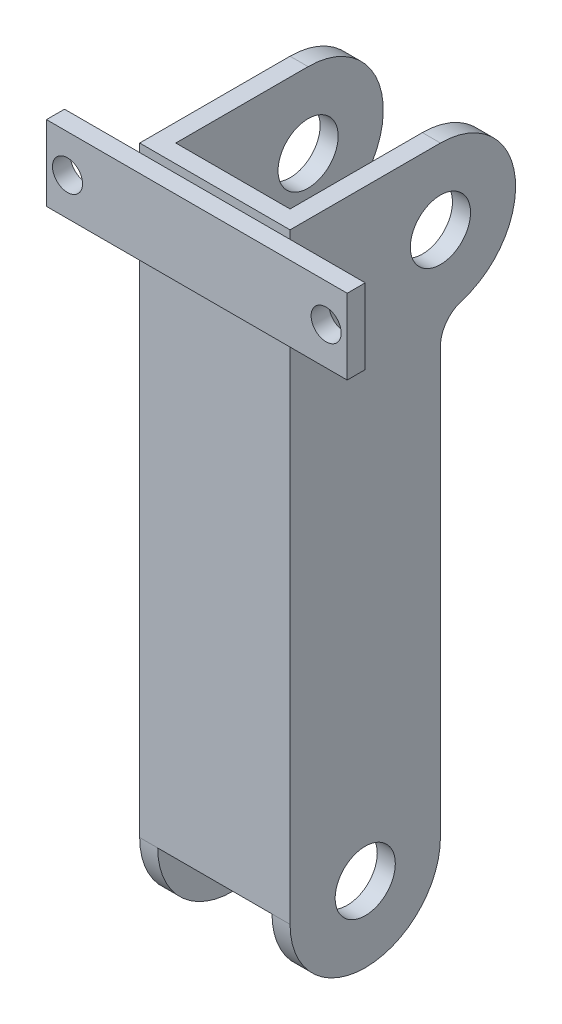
ISO-10303-21;
HEADER;
FILE_DESCRIPTION(('STEP AP214'),'2;1');
FILE_NAME('part.step','',(''),(''),'','','');
FILE_SCHEMA(('AUTOMOTIVE_DESIGN { 1 0 10303 214 1 1 1 1 }'));
ENDSEC;
DATA;
#1=APPLICATION_CONTEXT('core data for automotive mechanical design processes');
#2=APPLICATION_PROTOCOL_DEFINITION('international standard','automotive_design',2000,#1);
#3=PRODUCT_CONTEXT('',#1,'mechanical');
#4=PRODUCT('Part','Part','',(#3));
#5=PRODUCT_RELATED_PRODUCT_CATEGORY('part','',(#4));
#6=PRODUCT_DEFINITION_FORMATION('','',#4);
#7=PRODUCT_DEFINITION_CONTEXT('part definition',#1,'design');
#8=PRODUCT_DEFINITION('design','',#6,#7);
#9=PRODUCT_DEFINITION_SHAPE('','',#8);
#10=(LENGTH_UNIT() NAMED_UNIT(*) SI_UNIT(.MILLI.,.METRE.));
#11=(NAMED_UNIT(*) PLANE_ANGLE_UNIT() SI_UNIT($,.RADIAN.));
#12=(NAMED_UNIT(*) SI_UNIT($,.STERADIAN.) SOLID_ANGLE_UNIT());
#13=UNCERTAINTY_MEASURE_WITH_UNIT(LENGTH_MEASURE(1.E-05),#10,'distance_accuracy_value','');
#14=(GEOMETRIC_REPRESENTATION_CONTEXT(3) GLOBAL_UNCERTAINTY_ASSIGNED_CONTEXT((#13)) GLOBAL_UNIT_ASSIGNED_CONTEXT((#10,
#11,#12)) REPRESENTATION_CONTEXT('',''));
#15=CARTESIAN_POINT('',(0.,0.,0.));
#16=DIRECTION('',(0.,0.,1.));
#17=DIRECTION('',(1.,0.,0.));
#18=AXIS2_PLACEMENT_3D('',#15,#16,#17);
#19=CARTESIAN_POINT('',(6.,0.,25.));
#20=DIRECTION('',(0.,0.,-1.));
#21=DIRECTION('',(0.,1.,0.));
#22=AXIS2_PLACEMENT_3D('',#19,#20,#21);
#23=PLANE('',#22);
#24=DIRECTION('',(1.,0.,0.));
#25=VECTOR('',#24,1.);
#26=CARTESIAN_POINT('',(75.,172.244241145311,25.));
#27=LINE('',#26,#25);
#28=CARTESIAN_POINT('',(0.,172.244241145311,25.));
#29=VERTEX_POINT('',#28);
#30=CARTESIAN_POINT('',(50.,172.244241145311,25.));
#31=VERTEX_POINT('',#30);
#32=EDGE_CURVE('E193',#29,#31,#27,.T.);
#33=ORIENTED_EDGE('',*,*,#32,.F.);
#34=DIRECTION('',(0.,-1.,0.));
#35=VECTOR('',#34,1.);
#36=CARTESIAN_POINT('',(0.,0.,25.));
#37=LINE('',#36,#35);
#38=CARTESIAN_POINT('',(0.,0.,25.));
#39=VERTEX_POINT('',#38);
#40=EDGE_CURVE('E443',#29,#39,#37,.T.);
#41=ORIENTED_EDGE('',*,*,#40,.T.);
#42=DIRECTION('',(-1.,0.,0.));
#43=VECTOR('',#42,1.);
#44=CARTESIAN_POINT('',(6.,0.,25.));
#45=LINE('',#44,#43);
#46=CARTESIAN_POINT('',(6.,0.,25.));
#47=VERTEX_POINT('',#46);
#48=EDGE_CURVE('E461',#47,#39,#45,.T.);
#49=ORIENTED_EDGE('',*,*,#48,.F.);
#50=DIRECTION('',(1.,0.,0.));
#51=VECTOR('',#50,1.);
#52=CARTESIAN_POINT('',(0.,0.,25.));
#53=LINE('',#52,#51);
#54=CARTESIAN_POINT('',(44.,0.,25.));
#55=VERTEX_POINT('',#54);
#56=EDGE_CURVE('E400',#47,#55,#53,.T.);
#57=ORIENTED_EDGE('',*,*,#56,.T.);
#58=DIRECTION('',(1.,0.,0.));
#59=VECTOR('',#58,1.);
#60=CARTESIAN_POINT('',(44.,0.,25.));
#61=LINE('',#60,#59);
#62=CARTESIAN_POINT('',(50.,0.,25.));
#63=VERTEX_POINT('',#62);
#64=EDGE_CURVE('E387',#55,#63,#61,.T.);
#65=ORIENTED_EDGE('',*,*,#64,.T.);
#66=DIRECTION('',(0.,1.,0.));
#67=VECTOR('',#66,1.);
#68=CARTESIAN_POINT('',(50.,0.,25.));
#69=LINE('',#68,#67);
#70=EDGE_CURVE('E405',#63,#31,#69,.T.);
#71=ORIENTED_EDGE('',*,*,#70,.T.);
#72=EDGE_LOOP('',(#33,#41,#49,#57,#65,#71));
#73=FACE_BOUND('',#72,.T.);
#74=ADVANCED_FACE('F179',(#73),#23,.F.);
#75=DIRECTION('',(-1.,0.,0.));
#76=VECTOR('',#75,1.);
#77=CARTESIAN_POINT('',(75.,197.244241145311,25.));
#78=LINE('',#77,#76);
#79=CARTESIAN_POINT('',(50.,197.244241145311,25.));
#80=VERTEX_POINT('',#79);
#81=CARTESIAN_POINT('',(0.,197.244241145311,25.));
#82=VERTEX_POINT('',#81);
#83=EDGE_CURVE('E202',#80,#82,#78,.T.);
#84=ORIENTED_EDGE('',*,*,#83,.F.);
#85=CARTESIAN_POINT('',(50.,200.,25.));
#86=VERTEX_POINT('',#85);
#87=EDGE_CURVE('E410',#80,#86,#69,.T.);
#88=ORIENTED_EDGE('',*,*,#87,.T.);
#89=DIRECTION('',(-1.,0.,0.));
#90=VECTOR('',#89,1.);
#91=CARTESIAN_POINT('',(6.,200.,25.));
#92=LINE('',#91,#90);
#93=CARTESIAN_POINT('',(0.,200.,25.));
#94=VERTEX_POINT('',#93);
#95=EDGE_CURVE('E463',#86,#94,#92,.T.);
#96=ORIENTED_EDGE('',*,*,#95,.T.);
#97=EDGE_CURVE('E444',#94,#82,#37,.T.);
#98=ORIENTED_EDGE('',*,*,#97,.T.);
#99=EDGE_LOOP('',(#84,#88,#96,#98));
#100=FACE_BOUND('',#99,.T.);
#101=ADVANCED_FACE('F509',(#100),#23,.F.);
#102=CARTESIAN_POINT('',(6.,175.,-25.));
#103=DIRECTION('',(1.,0.,0.));
#104=DIRECTION('',(0.,0.,-1.));
#105=AXIS2_PLACEMENT_3D('',#102,#103,#104);
#106=PLANE('',#105);
#107=DIRECTION('',(0.,0.,-1.));
#108=VECTOR('',#107,1.);
#109=CARTESIAN_POINT('',(6.,0.,-25.));
#110=LINE('',#109,#108);
#111=CARTESIAN_POINT('',(6.,0.,19.));
#112=VERTEX_POINT('',#111);
#113=EDGE_CURVE('E189',#47,#112,#110,.T.);
#114=ORIENTED_EDGE('',*,*,#113,.F.);
#115=CARTESIAN_POINT('',(6.,0.,0.));
#116=DIRECTION('',(1.,0.,0.));
#117=DIRECTION('',(0.,0.,-1.));
#118=AXIS2_PLACEMENT_3D('',#115,#116,#117);
#119=CIRCLE('',#118,25.);
#120=CARTESIAN_POINT('',(6.,0.,-25.));
#121=VERTEX_POINT('',#120);
#122=EDGE_CURVE('E435',#47,#121,#119,.T.);
#123=ORIENTED_EDGE('',*,*,#122,.T.);
#124=DIRECTION('',(0.,1.,0.));
#125=VECTOR('',#124,1.);
#126=CARTESIAN_POINT('',(6.,0.,-25.));
#127=LINE('',#126,#125);
#128=CARTESIAN_POINT('',(6.,141.458980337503,-25.));
#129=VERTEX_POINT('',#128);
#130=EDGE_CURVE('E432',#121,#129,#127,.T.);
#131=ORIENTED_EDGE('',*,*,#130,.T.);
#132=CARTESIAN_POINT('',(6.,141.458980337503,-35.));
#133=DIRECTION('',(-1.,0.,0.));
#134=DIRECTION('',(0.,0.,-1.));
#135=AXIS2_PLACEMENT_3D('',#132,#133,#134);
#136=CIRCLE('',#135,10.);
#137=CARTESIAN_POINT('',(6.,151.042128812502,-32.1428571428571));
#138=VERTEX_POINT('',#137);
#139=EDGE_CURVE('E436',#129,#138,#136,.T.);
#140=ORIENTED_EDGE('',*,*,#139,.T.);
#141=CARTESIAN_POINT('',(6.,175.,-25.));
#142=DIRECTION('',(1.,0.,0.));
#143=DIRECTION('',(0.,0.,-1.));
#144=AXIS2_PLACEMENT_3D('',#141,#142,#143);
#145=CIRCLE('',#144,25.);
#146=CARTESIAN_POINT('',(6.,200.,-25.));
#147=VERTEX_POINT('',#146);
#148=EDGE_CURVE('E424',#138,#147,#145,.T.);
#149=ORIENTED_EDGE('',*,*,#148,.T.);
#150=DIRECTION('',(0.,0.,1.));
#151=VECTOR('',#150,1.);
#152=CARTESIAN_POINT('',(6.,200.,-25.));
#153=LINE('',#152,#151);
#154=CARTESIAN_POINT('',(6.,200.,19.));
#155=VERTEX_POINT('',#154);
#156=EDGE_CURVE('E426',#147,#155,#153,.T.);
#157=ORIENTED_EDGE('',*,*,#156,.T.);
#158=DIRECTION('',(0.,1.,0.));
#159=VECTOR('',#158,1.);
#160=CARTESIAN_POINT('',(6.,175.,19.));
#161=LINE('',#160,#159);
#162=EDGE_CURVE('E469',#112,#155,#161,.T.);
#163=ORIENTED_EDGE('',*,*,#162,.F.);
#164=EDGE_LOOP('',(#114,#123,#131,#140,#149,#157,#163));
#165=FACE_BOUND('',#164,.T.);
#166=CARTESIAN_POINT('',(6.,0.,0.));
#167=DIRECTION('',(1.,0.,0.));
#168=DIRECTION('',(0.,0.,-1.));
#169=AXIS2_PLACEMENT_3D('',#166,#167,#168);
#170=CIRCLE('',#169,10.);
#171=CARTESIAN_POINT('',(6.,0.,-10.));
#172=VERTEX_POINT('',#171);
#173=EDGE_CURVE('E418',#172,#172,#170,.T.);
#174=ORIENTED_EDGE('',*,*,#173,.F.);
#175=EDGE_LOOP('',(#174));
#176=FACE_BOUND('',#175,.T.);
#177=CARTESIAN_POINT('',(6.,175.,-25.));
#178=DIRECTION('',(1.,0.,0.));
#179=DIRECTION('',(0.,0.,-1.));
#180=AXIS2_PLACEMENT_3D('',#177,#178,#179);
#181=CIRCLE('',#180,10.);
#182=CARTESIAN_POINT('',(6.,175.,-35.));
#183=VERTEX_POINT('',#182);
#184=EDGE_CURVE('E413',#183,#183,#181,.T.);
#185=ORIENTED_EDGE('',*,*,#184,.F.);
#186=EDGE_LOOP('',(#185));
#187=FACE_BOUND('',#186,.T.);
#188=ADVANCED_FACE('F579',(#165,#176,#187),#106,.T.);
#189=CARTESIAN_POINT('',(0.,175.,-25.));
#190=DIRECTION('',(1.,0.,0.));
#191=DIRECTION('',(0.,0.,-1.));
#192=AXIS2_PLACEMENT_3D('',#189,#190,#191);
#193=PLANE('',#192);
#194=ORIENTED_EDGE('',*,*,#97,.F.);
#195=DIRECTION('',(0.,0.,1.));
#196=VECTOR('',#195,1.);
#197=CARTESIAN_POINT('',(0.,200.,-25.));
#198=LINE('',#197,#196);
#199=CARTESIAN_POINT('',(0.,200.,-25.));
#200=VERTEX_POINT('',#199);
#201=EDGE_CURVE('E441',#200,#94,#198,.T.);
#202=ORIENTED_EDGE('',*,*,#201,.F.);
#203=CARTESIAN_POINT('',(0.,175.,-25.));
#204=DIRECTION('',(1.,0.,0.));
#205=DIRECTION('',(0.,0.,-1.));
#206=AXIS2_PLACEMENT_3D('',#203,#204,#205);
#207=CIRCLE('',#206,25.);
#208=CARTESIAN_POINT('',(0.,151.042128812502,-32.1428571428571));
#209=VERTEX_POINT('',#208);
#210=EDGE_CURVE('E422',#209,#200,#207,.T.);
#211=ORIENTED_EDGE('',*,*,#210,.F.);
#212=CARTESIAN_POINT('',(0.,141.458980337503,-35.));
#213=DIRECTION('',(-1.,0.,0.));
#214=DIRECTION('',(0.,0.,-1.));
#215=AXIS2_PLACEMENT_3D('',#212,#213,#214);
#216=CIRCLE('',#215,10.);
#217=CARTESIAN_POINT('',(0.,141.458980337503,-25.));
#218=VERTEX_POINT('',#217);
#219=EDGE_CURVE('E429',#218,#209,#216,.T.);
#220=ORIENTED_EDGE('',*,*,#219,.F.);
#221=DIRECTION('',(0.,1.,0.));
#222=VECTOR('',#221,1.);
#223=CARTESIAN_POINT('',(0.,0.,-25.));
#224=LINE('',#223,#222);
#225=CARTESIAN_POINT('',(0.,0.,-25.));
#226=VERTEX_POINT('',#225);
#227=EDGE_CURVE('E448',#226,#218,#224,.T.);
#228=ORIENTED_EDGE('',*,*,#227,.F.);
#229=CARTESIAN_POINT('',(0.,0.,0.));
#230=DIRECTION('',(1.,0.,0.));
#231=DIRECTION('',(0.,0.,-1.));
#232=AXIS2_PLACEMENT_3D('',#229,#230,#231);
#233=CIRCLE('',#232,25.);
#234=EDGE_CURVE('E450',#39,#226,#233,.T.);
#235=ORIENTED_EDGE('',*,*,#234,.F.);
#236=ORIENTED_EDGE('',*,*,#40,.F.);
#237=EDGE_CURVE('E449',#82,#29,#37,.T.);
#238=ORIENTED_EDGE('',*,*,#237,.F.);
#239=EDGE_LOOP('',(#194,#202,#211,#220,#228,#235,#236,#238));
#240=FACE_BOUND('',#239,.T.);
#241=CARTESIAN_POINT('',(0.,175.,-25.));
#242=DIRECTION('',(1.,0.,0.));
#243=DIRECTION('',(0.,0.,-1.));
#244=AXIS2_PLACEMENT_3D('',#241,#242,#243);
#245=CIRCLE('',#244,10.);
#246=CARTESIAN_POINT('',(0.,175.,-35.));
#247=VERTEX_POINT('',#246);
#248=EDGE_CURVE('E415',#247,#247,#245,.T.);
#249=ORIENTED_EDGE('',*,*,#248,.T.);
#250=EDGE_LOOP('',(#249));
#251=FACE_BOUND('',#250,.T.);
#252=CARTESIAN_POINT('',(0.,0.,0.));
#253=DIRECTION('',(1.,0.,0.));
#254=DIRECTION('',(0.,0.,-1.));
#255=AXIS2_PLACEMENT_3D('',#252,#253,#254);
#256=CIRCLE('',#255,10.);
#257=CARTESIAN_POINT('',(0.,0.,-10.));
#258=VERTEX_POINT('',#257);
#259=EDGE_CURVE('E416',#258,#258,#256,.T.);
#260=ORIENTED_EDGE('',*,*,#259,.T.);
#261=EDGE_LOOP('',(#260));
#262=FACE_BOUND('',#261,.T.);
#263=ADVANCED_FACE('F517',(#240,#251,#262),#193,.F.);
#264=CARTESIAN_POINT('',(6.,175.,-25.));
#265=DIRECTION('',(-1.,0.,0.));
#266=DIRECTION('',(0.,0.,1.));
#267=AXIS2_PLACEMENT_3D('',#264,#265,#266);
#268=CYLINDRICAL_SURFACE('',#267,25.);
#269=ORIENTED_EDGE('',*,*,#210,.T.);
#270=DIRECTION('',(-1.,0.,0.));
#271=VECTOR('',#270,1.);
#272=CARTESIAN_POINT('',(6.,200.,-25.));
#273=LINE('',#272,#271);
#274=EDGE_CURVE('E467',#147,#200,#273,.T.);
#275=ORIENTED_EDGE('',*,*,#274,.F.);
#276=ORIENTED_EDGE('',*,*,#148,.F.);
#277=DIRECTION('',(-1.,0.,0.));
#278=VECTOR('',#277,1.);
#279=CARTESIAN_POINT('',(6.,151.042128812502,-32.1428571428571));
#280=LINE('',#279,#278);
#281=EDGE_CURVE('E438',#138,#209,#280,.T.);
#282=ORIENTED_EDGE('',*,*,#281,.T.);
#283=EDGE_LOOP('',(#269,#275,#276,#282));
#284=FACE_BOUND('',#283,.T.);
#285=ADVANCED_FACE('F185',(#284),#268,.T.);
#286=CARTESIAN_POINT('',(6.,200.,-25.));
#287=DIRECTION('',(0.,-1.,0.));
#288=DIRECTION('',(0.,0.,-1.));
#289=AXIS2_PLACEMENT_3D('',#286,#287,#288);
#290=PLANE('',#289);
#291=DIRECTION('',(0.,0.,1.));
#292=VECTOR('',#291,1.);
#293=CARTESIAN_POINT('',(50.,200.,19.));
#294=LINE('',#293,#292);
#295=CARTESIAN_POINT('',(50.,200.,-25.));
#296=VERTEX_POINT('',#295);
#297=EDGE_CURVE('E404',#296,#86,#294,.T.);
#298=ORIENTED_EDGE('',*,*,#297,.F.);
#299=DIRECTION('',(1.,0.,0.));
#300=VECTOR('',#299,1.);
#301=CARTESIAN_POINT('',(44.,200.,-25.));
#302=LINE('',#301,#300);
#303=CARTESIAN_POINT('',(44.,200.,-25.));
#304=VERTEX_POINT('',#303);
#305=EDGE_CURVE('E373',#304,#296,#302,.T.);
#306=ORIENTED_EDGE('',*,*,#305,.F.);
#307=DIRECTION('',(0.,0.,1.));
#308=VECTOR('',#307,1.);
#309=CARTESIAN_POINT('',(44.,200.,-25.));
#310=LINE('',#309,#308);
#311=CARTESIAN_POINT('',(44.,200.,19.));
#312=VERTEX_POINT('',#311);
#313=EDGE_CURVE('E369',#304,#312,#310,.T.);
#314=ORIENTED_EDGE('',*,*,#313,.T.);
#315=DIRECTION('',(-1.,0.,0.));
#316=VECTOR('',#315,1.);
#317=CARTESIAN_POINT('',(0.,200.,19.));
#318=LINE('',#317,#316);
#319=EDGE_CURVE('E402',#312,#155,#318,.T.);
#320=ORIENTED_EDGE('',*,*,#319,.T.);
#321=ORIENTED_EDGE('',*,*,#156,.F.);
#322=ORIENTED_EDGE('',*,*,#274,.T.);
#323=ORIENTED_EDGE('',*,*,#201,.T.);
#324=ORIENTED_EDGE('',*,*,#95,.F.);
#325=EDGE_LOOP('',(#298,#306,#314,#320,#321,#322,#323,#324));
#326=FACE_BOUND('',#325,.T.);
#327=ADVANCED_FACE('F488',(#326),#290,.F.);
#328=CARTESIAN_POINT('',(6.,0.,0.));
#329=DIRECTION('',(-1.,0.,0.));
#330=DIRECTION('',(0.,0.,1.));
#331=AXIS2_PLACEMENT_3D('',#328,#329,#330);
#332=CYLINDRICAL_SURFACE('',#331,25.);
#333=ORIENTED_EDGE('',*,*,#234,.T.);
#334=DIRECTION('',(-1.,0.,0.));
#335=VECTOR('',#334,1.);
#336=CARTESIAN_POINT('',(6.,0.,-25.));
#337=LINE('',#336,#335);
#338=EDGE_CURVE('E458',#121,#226,#337,.T.);
#339=ORIENTED_EDGE('',*,*,#338,.F.);
#340=ORIENTED_EDGE('',*,*,#122,.F.);
#341=ORIENTED_EDGE('',*,*,#48,.T.);
#342=EDGE_LOOP('',(#333,#339,#340,#341));
#343=FACE_BOUND('',#342,.T.);
#344=ADVANCED_FACE('F578',(#343),#332,.T.);
#345=CARTESIAN_POINT('',(6.,0.,-25.));
#346=DIRECTION('',(0.,0.,1.));
#347=DIRECTION('',(0.,-1.,0.));
#348=AXIS2_PLACEMENT_3D('',#345,#346,#347);
#349=PLANE('',#348);
#350=ORIENTED_EDGE('',*,*,#227,.T.);
#351=DIRECTION('',(-1.,0.,0.));
#352=VECTOR('',#351,1.);
#353=CARTESIAN_POINT('',(6.,141.458980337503,-25.));
#354=LINE('',#353,#352);
#355=EDGE_CURVE('E453',#129,#218,#354,.T.);
#356=ORIENTED_EDGE('',*,*,#355,.F.);
#357=ORIENTED_EDGE('',*,*,#130,.F.);
#358=ORIENTED_EDGE('',*,*,#338,.T.);
#359=EDGE_LOOP('',(#350,#356,#357,#358));
#360=FACE_BOUND('',#359,.T.);
#361=ADVANCED_FACE('F590',(#360),#349,.F.);
#362=CARTESIAN_POINT('',(6.,141.458980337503,-35.));
#363=DIRECTION('',(-1.,0.,0.));
#364=DIRECTION('',(0.,0.,1.));
#365=AXIS2_PLACEMENT_3D('',#362,#363,#364);
#366=CYLINDRICAL_SURFACE('',#365,10.);
#367=ORIENTED_EDGE('',*,*,#219,.T.);
#368=ORIENTED_EDGE('',*,*,#281,.F.);
#369=ORIENTED_EDGE('',*,*,#139,.F.);
#370=ORIENTED_EDGE('',*,*,#355,.T.);
#371=EDGE_LOOP('',(#367,#368,#369,#370));
#372=FACE_BOUND('',#371,.T.);
#373=ADVANCED_FACE('F602',(#372),#366,.F.);
#374=CARTESIAN_POINT('',(6.,0.,0.));
#375=DIRECTION('',(-1.,0.,0.));
#376=DIRECTION('',(0.,0.,1.));
#377=AXIS2_PLACEMENT_3D('',#374,#375,#376);
#378=CYLINDRICAL_SURFACE('',#377,10.);
#379=ORIENTED_EDGE('',*,*,#173,.T.);
#380=EDGE_LOOP('',(#379));
#381=FACE_BOUND('',#380,.T.);
#382=ORIENTED_EDGE('',*,*,#259,.F.);
#383=EDGE_LOOP('',(#382));
#384=FACE_BOUND('',#383,.T.);
#385=ADVANCED_FACE('F616',(#381,#384),#378,.F.);
#386=CARTESIAN_POINT('',(6.,175.,-25.));
#387=DIRECTION('',(-1.,0.,0.));
#388=DIRECTION('',(0.,0.,1.));
#389=AXIS2_PLACEMENT_3D('',#386,#387,#388);
#390=CYLINDRICAL_SURFACE('',#389,10.);
#391=ORIENTED_EDGE('',*,*,#184,.T.);
#392=EDGE_LOOP('',(#391));
#393=FACE_BOUND('',#392,.T.);
#394=ORIENTED_EDGE('',*,*,#248,.F.);
#395=EDGE_LOOP('',(#394));
#396=FACE_BOUND('',#395,.T.);
#397=ADVANCED_FACE('F614',(#393,#396),#390,.F.);
#398=CARTESIAN_POINT('',(50.,0.,19.));
#399=DIRECTION('',(1.,0.,0.));
#400=DIRECTION('',(0.,1.,0.));
#401=AXIS2_PLACEMENT_3D('',#398,#399,#400);
#402=PLANE('',#401);
#403=ORIENTED_EDGE('',*,*,#70,.F.);
#404=CARTESIAN_POINT('',(50.,0.,0.));
#405=DIRECTION('',(1.,0.,0.));
#406=DIRECTION('',(0.,0.,-1.));
#407=AXIS2_PLACEMENT_3D('',#404,#405,#406);
#408=CIRCLE('',#407,25.);
#409=CARTESIAN_POINT('',(50.,0.,-25.));
#410=VERTEX_POINT('',#409);
#411=EDGE_CURVE('E363',#63,#410,#408,.T.);
#412=ORIENTED_EDGE('',*,*,#411,.T.);
#413=DIRECTION('',(0.,1.,0.));
#414=VECTOR('',#413,1.);
#415=CARTESIAN_POINT('',(50.,0.,-25.));
#416=LINE('',#415,#414);
#417=CARTESIAN_POINT('',(50.,141.458980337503,-25.));
#418=VERTEX_POINT('',#417);
#419=EDGE_CURVE('E378',#410,#418,#416,.T.);
#420=ORIENTED_EDGE('',*,*,#419,.T.);
#421=CARTESIAN_POINT('',(50.,141.458980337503,-35.));
#422=DIRECTION('',(-1.,0.,0.));
#423=DIRECTION('',(0.,0.,-1.));
#424=AXIS2_PLACEMENT_3D('',#421,#422,#423);
#425=CIRCLE('',#424,10.);
#426=CARTESIAN_POINT('',(50.,151.042128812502,-32.1428571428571));
#427=VERTEX_POINT('',#426);
#428=EDGE_CURVE('E376',#418,#427,#425,.T.);
#429=ORIENTED_EDGE('',*,*,#428,.T.);
#430=CARTESIAN_POINT('',(50.,175.,-25.));
#431=DIRECTION('',(1.,0.,0.));
#432=DIRECTION('',(0.,0.,-1.));
#433=AXIS2_PLACEMENT_3D('',#430,#431,#432);
#434=CIRCLE('',#433,25.);
#435=EDGE_CURVE('E353',#427,#296,#434,.T.);
#436=ORIENTED_EDGE('',*,*,#435,.T.);
#437=ORIENTED_EDGE('',*,*,#297,.T.);
#438=ORIENTED_EDGE('',*,*,#87,.F.);
#439=EDGE_CURVE('E406',#31,#80,#69,.T.);
#440=ORIENTED_EDGE('',*,*,#439,.F.);
#441=EDGE_LOOP('',(#403,#412,#420,#429,#436,#437,#438,#440));
#442=FACE_BOUND('',#441,.T.);
#443=CARTESIAN_POINT('',(50.,175.,-25.));
#444=DIRECTION('',(1.,0.,0.));
#445=DIRECTION('',(0.,0.,-1.));
#446=AXIS2_PLACEMENT_3D('',#443,#444,#445);
#447=CIRCLE('',#446,10.);
#448=CARTESIAN_POINT('',(50.,175.,-35.));
#449=VERTEX_POINT('',#448);
#450=EDGE_CURVE('E339',#449,#449,#447,.T.);
#451=ORIENTED_EDGE('',*,*,#450,.F.);
#452=EDGE_LOOP('',(#451));
#453=FACE_BOUND('',#452,.T.);
#454=CARTESIAN_POINT('',(50.,0.,0.));
#455=DIRECTION('',(1.,0.,0.));
#456=DIRECTION('',(0.,0.,-1.));
#457=AXIS2_PLACEMENT_3D('',#454,#455,#456);
#458=CIRCLE('',#457,10.);
#459=CARTESIAN_POINT('',(50.,0.,-10.));
#460=VERTEX_POINT('',#459);
#461=EDGE_CURVE('E347',#460,#460,#458,.T.);
#462=ORIENTED_EDGE('',*,*,#461,.F.);
#463=EDGE_LOOP('',(#462));
#464=FACE_BOUND('',#463,.T.);
#465=ADVANCED_FACE('F506',(#442,#453,#464),#402,.T.);
#466=CARTESIAN_POINT('',(0.,0.,19.));
#467=DIRECTION('',(0.,-1.,0.));
#468=DIRECTION('',(1.,0.,0.));
#469=AXIS2_PLACEMENT_3D('',#466,#467,#468);
#470=PLANE('',#469);
#471=DIRECTION('',(0.,0.,-1.));
#472=VECTOR('',#471,1.);
#473=CARTESIAN_POINT('',(44.,0.,19.));
#474=LINE('',#473,#472);
#475=CARTESIAN_POINT('',(44.,0.,19.));
#476=VERTEX_POINT('',#475);
#477=EDGE_CURVE('E392',#55,#476,#474,.T.);
#478=ORIENTED_EDGE('',*,*,#477,.F.);
#479=ORIENTED_EDGE('',*,*,#56,.F.);
#480=ORIENTED_EDGE('',*,*,#113,.T.);
#481=DIRECTION('',(1.,0.,0.));
#482=VECTOR('',#481,1.);
#483=CARTESIAN_POINT('',(0.,0.,19.));
#484=LINE('',#483,#482);
#485=EDGE_CURVE('E397',#112,#476,#484,.T.);
#486=ORIENTED_EDGE('',*,*,#485,.T.);
#487=EDGE_LOOP('',(#478,#479,#480,#486));
#488=FACE_BOUND('',#487,.T.);
#489=ADVANCED_FACE('F473',(#488),#470,.T.);
#490=CARTESIAN_POINT('',(0.,0.,19.));
#491=DIRECTION('',(0.,0.,-1.));
#492=DIRECTION('',(-1.,0.,0.));
#493=AXIS2_PLACEMENT_3D('',#490,#491,#492);
#494=PLANE('',#493);
#495=DIRECTION('',(0.,1.,0.));
#496=VECTOR('',#495,1.);
#497=CARTESIAN_POINT('',(44.,0.,19.));
#498=LINE('',#497,#496);
#499=EDGE_CURVE('E12',#476,#312,#498,.T.);
#500=ORIENTED_EDGE('',*,*,#499,.F.);
#501=ORIENTED_EDGE('',*,*,#485,.F.);
#502=ORIENTED_EDGE('',*,*,#162,.T.);
#503=ORIENTED_EDGE('',*,*,#319,.F.);
#504=EDGE_LOOP('',(#500,#501,#502,#503));
#505=FACE_BOUND('',#504,.T.);
#506=ADVANCED_FACE('F477',(#505),#494,.T.);
#507=CARTESIAN_POINT('',(44.,175.,-25.));
#508=DIRECTION('',(1.,0.,0.));
#509=DIRECTION('',(0.,0.,-1.));
#510=AXIS2_PLACEMENT_3D('',#507,#508,#509);
#511=CYLINDRICAL_SURFACE('',#510,25.);
#512=ORIENTED_EDGE('',*,*,#435,.F.);
#513=DIRECTION('',(1.,0.,0.));
#514=VECTOR('',#513,1.);
#515=CARTESIAN_POINT('',(44.,151.042128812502,-32.1428571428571));
#516=LINE('',#515,#514);
#517=CARTESIAN_POINT('',(44.,151.042128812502,-32.1428571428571));
#518=VERTEX_POINT('',#517);
#519=EDGE_CURVE('E395',#518,#427,#516,.T.);
#520=ORIENTED_EDGE('',*,*,#519,.F.);
#521=CARTESIAN_POINT('',(44.,175.,-25.));
#522=DIRECTION('',(1.,0.,0.));
#523=DIRECTION('',(0.,0.,-1.));
#524=AXIS2_PLACEMENT_3D('',#521,#522,#523);
#525=CIRCLE('',#524,25.);
#526=EDGE_CURVE('E357',#518,#304,#525,.T.);
#527=ORIENTED_EDGE('',*,*,#526,.T.);
#528=ORIENTED_EDGE('',*,*,#305,.T.);
#529=EDGE_LOOP('',(#512,#520,#527,#528));
#530=FACE_BOUND('',#529,.T.);
#531=ADVANCED_FACE('F489',(#530),#511,.T.);
#532=CARTESIAN_POINT('',(44.,141.458980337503,-35.));
#533=DIRECTION('',(1.,0.,0.));
#534=DIRECTION('',(0.,0.,-1.));
#535=AXIS2_PLACEMENT_3D('',#532,#533,#534);
#536=CYLINDRICAL_SURFACE('',#535,10.);
#537=ORIENTED_EDGE('',*,*,#428,.F.);
#538=DIRECTION('',(1.,0.,0.));
#539=VECTOR('',#538,1.);
#540=CARTESIAN_POINT('',(44.,141.458980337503,-25.));
#541=LINE('',#540,#539);
#542=CARTESIAN_POINT('',(44.,141.458980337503,-25.));
#543=VERTEX_POINT('',#542);
#544=EDGE_CURVE('E388',#543,#418,#541,.T.);
#545=ORIENTED_EDGE('',*,*,#544,.F.);
#546=CARTESIAN_POINT('',(44.,141.458980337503,-35.));
#547=DIRECTION('',(-1.,0.,0.));
#548=DIRECTION('',(0.,0.,-1.));
#549=AXIS2_PLACEMENT_3D('',#546,#547,#548);
#550=CIRCLE('',#549,10.);
#551=EDGE_CURVE('E359',#543,#518,#550,.T.);
#552=ORIENTED_EDGE('',*,*,#551,.T.);
#553=ORIENTED_EDGE('',*,*,#519,.T.);
#554=EDGE_LOOP('',(#537,#545,#552,#553));
#555=FACE_BOUND('',#554,.T.);
#556=ADVANCED_FACE('F492',(#555),#536,.F.);
#557=CARTESIAN_POINT('',(44.,0.,-25.));
#558=DIRECTION('',(0.,0.,-1.));
#559=DIRECTION('',(0.,1.,0.));
#560=AXIS2_PLACEMENT_3D('',#557,#558,#559);
#561=PLANE('',#560);
#562=ORIENTED_EDGE('',*,*,#419,.F.);
#563=DIRECTION('',(1.,0.,0.));
#564=VECTOR('',#563,1.);
#565=CARTESIAN_POINT('',(44.,0.,-25.));
#566=LINE('',#565,#564);
#567=CARTESIAN_POINT('',(44.,0.,-25.));
#568=VERTEX_POINT('',#567);
#569=EDGE_CURVE('E389',#568,#410,#566,.T.);
#570=ORIENTED_EDGE('',*,*,#569,.F.);
#571=DIRECTION('',(0.,1.,0.));
#572=VECTOR('',#571,1.);
#573=CARTESIAN_POINT('',(44.,0.,-25.));
#574=LINE('',#573,#572);
#575=EDGE_CURVE('E364',#568,#543,#574,.T.);
#576=ORIENTED_EDGE('',*,*,#575,.T.);
#577=ORIENTED_EDGE('',*,*,#544,.T.);
#578=EDGE_LOOP('',(#562,#570,#576,#577));
#579=FACE_BOUND('',#578,.T.);
#580=ADVANCED_FACE('F498',(#579),#561,.T.);
#581=CARTESIAN_POINT('',(44.,0.,0.));
#582=DIRECTION('',(1.,0.,0.));
#583=DIRECTION('',(0.,0.,-1.));
#584=AXIS2_PLACEMENT_3D('',#581,#582,#583);
#585=CYLINDRICAL_SURFACE('',#584,25.);
#586=ORIENTED_EDGE('',*,*,#411,.F.);
#587=ORIENTED_EDGE('',*,*,#64,.F.);
#588=CARTESIAN_POINT('',(44.,0.,0.));
#589=DIRECTION('',(1.,0.,0.));
#590=DIRECTION('',(0.,0.,-1.));
#591=AXIS2_PLACEMENT_3D('',#588,#589,#590);
#592=CIRCLE('',#591,25.);
#593=EDGE_CURVE('E370',#55,#568,#592,.T.);
#594=ORIENTED_EDGE('',*,*,#593,.T.);
#595=ORIENTED_EDGE('',*,*,#569,.T.);
#596=EDGE_LOOP('',(#586,#587,#594,#595));
#597=FACE_BOUND('',#596,.T.);
#598=ADVANCED_FACE('F505',(#597),#585,.T.);
#599=CARTESIAN_POINT('',(44.,175.,-25.));
#600=DIRECTION('',(-1.,0.,0.));
#601=DIRECTION('',(0.,0.,-1.));
#602=AXIS2_PLACEMENT_3D('',#599,#600,#601);
#603=PLANE('',#602);
#604=CARTESIAN_POINT('',(44.,175.,-25.));
#605=DIRECTION('',(1.,0.,0.));
#606=DIRECTION('',(0.,0.,-1.));
#607=AXIS2_PLACEMENT_3D('',#604,#605,#606);
#608=CIRCLE('',#607,10.);
#609=CARTESIAN_POINT('',(44.,175.,-35.));
#610=VERTEX_POINT('',#609);
#611=EDGE_CURVE('E345',#610,#610,#608,.T.);
#612=ORIENTED_EDGE('',*,*,#611,.T.);
#613=EDGE_LOOP('',(#612));
#614=FACE_BOUND('',#613,.T.);
#615=CARTESIAN_POINT('',(44.,0.,0.));
#616=DIRECTION('',(1.,0.,0.));
#617=DIRECTION('',(0.,0.,-1.));
#618=AXIS2_PLACEMENT_3D('',#615,#616,#617);
#619=CIRCLE('',#618,10.);
#620=CARTESIAN_POINT('',(44.,0.,-10.));
#621=VERTEX_POINT('',#620);
#622=EDGE_CURVE('E351',#621,#621,#619,.T.);
#623=ORIENTED_EDGE('',*,*,#622,.T.);
#624=EDGE_LOOP('',(#623));
#625=FACE_BOUND('',#624,.T.);
#626=ORIENTED_EDGE('',*,*,#593,.F.);
#627=ORIENTED_EDGE('',*,*,#477,.T.);
#628=ORIENTED_EDGE('',*,*,#499,.T.);
#629=ORIENTED_EDGE('',*,*,#313,.F.);
#630=ORIENTED_EDGE('',*,*,#526,.F.);
#631=ORIENTED_EDGE('',*,*,#551,.F.);
#632=ORIENTED_EDGE('',*,*,#575,.F.);
#633=EDGE_LOOP('',(#626,#627,#628,#629,#630,#631,#632));
#634=FACE_BOUND('',#633,.T.);
#635=ADVANCED_FACE('F482',(#614,#625,#634),#603,.T.);
#636=CARTESIAN_POINT('',(44.,0.,0.));
#637=DIRECTION('',(1.,0.,0.));
#638=DIRECTION('',(0.,0.,-1.));
#639=AXIS2_PLACEMENT_3D('',#636,#637,#638);
#640=CYLINDRICAL_SURFACE('',#639,10.);
#641=ORIENTED_EDGE('',*,*,#622,.F.);
#642=EDGE_LOOP('',(#641));
#643=FACE_BOUND('',#642,.T.);
#644=ORIENTED_EDGE('',*,*,#461,.T.);
#645=EDGE_LOOP('',(#644));
#646=FACE_BOUND('',#645,.T.);
#647=ADVANCED_FACE('F719',(#643,#646),#640,.F.);
#648=CARTESIAN_POINT('',(44.,175.,-25.));
#649=DIRECTION('',(1.,0.,0.));
#650=DIRECTION('',(0.,0.,-1.));
#651=AXIS2_PLACEMENT_3D('',#648,#649,#650);
#652=CYLINDRICAL_SURFACE('',#651,10.);
#653=ORIENTED_EDGE('',*,*,#611,.F.);
#654=EDGE_LOOP('',(#653));
#655=FACE_BOUND('',#654,.T.);
#656=ORIENTED_EDGE('',*,*,#450,.T.);
#657=EDGE_LOOP('',(#656));
#658=FACE_BOUND('',#657,.T.);
#659=ADVANCED_FACE('F567',(#655,#658),#652,.F.);
#660=CARTESIAN_POINT('',(0.,0.,25.));
#661=DIRECTION('',(0.,0.,-1.));
#662=DIRECTION('',(-1.,0.,0.));
#663=AXIS2_PLACEMENT_3D('',#660,#661,#662);
#664=PLANE('',#663);
#665=CARTESIAN_POINT('',(-18.,184.744241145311,25.));
#666=DIRECTION('',(0.,0.,1.));
#667=DIRECTION('',(1.,0.,0.));
#668=AXIS2_PLACEMENT_3D('',#665,#666,#667);
#669=CIRCLE('',#668,5.00000000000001);
#670=CARTESIAN_POINT('',(-13.,184.744241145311,25.));
#671=VERTEX_POINT('',#670);
#672=EDGE_CURVE('E544',#671,#671,#669,.T.);
#673=ORIENTED_EDGE('',*,*,#672,.T.);
#674=EDGE_LOOP('',(#673));
#675=FACE_BOUND('',#674,.T.);
#676=CARTESIAN_POINT('',(-25.,197.244241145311,25.));
#677=VERTEX_POINT('',#676);
#678=EDGE_CURVE('E524',#82,#677,#78,.T.);
#679=ORIENTED_EDGE('',*,*,#678,.F.);
#680=ORIENTED_EDGE('',*,*,#237,.T.);
#681=CARTESIAN_POINT('',(-25.,172.244241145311,25.));
#682=VERTEX_POINT('',#681);
#683=EDGE_CURVE('E333',#682,#29,#27,.T.);
#684=ORIENTED_EDGE('',*,*,#683,.F.);
#685=DIRECTION('',(0.,-1.,0.));
#686=VECTOR('',#685,1.);
#687=CARTESIAN_POINT('',(-25.,197.244241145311,25.));
#688=LINE('',#687,#686);
#689=EDGE_CURVE('E530',#677,#682,#688,.T.);
#690=ORIENTED_EDGE('',*,*,#689,.F.);
#691=EDGE_LOOP('',(#679,#680,#684,#690));
#692=FACE_BOUND('',#691,.T.);
#693=ADVANCED_FACE('F526',(#675,#692),#664,.T.);
#694=CARTESIAN_POINT('',(0.,0.,31.));
#695=DIRECTION('',(0.,0.,-1.));
#696=DIRECTION('',(-1.,0.,0.));
#697=AXIS2_PLACEMENT_3D('',#694,#695,#696);
#698=PLANE('',#697);
#699=DIRECTION('',(0.,1.,0.));
#700=VECTOR('',#699,1.);
#701=CARTESIAN_POINT('',(75.,197.244241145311,31.));
#702=LINE('',#701,#700);
#703=CARTESIAN_POINT('',(75.,172.244241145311,31.));
#704=VERTEX_POINT('',#703);
#705=CARTESIAN_POINT('',(75.,197.244241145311,31.));
#706=VERTEX_POINT('',#705);
#707=EDGE_CURVE('E321',#704,#706,#702,.T.);
#708=ORIENTED_EDGE('',*,*,#707,.T.);
#709=DIRECTION('',(-1.,0.,0.));
#710=VECTOR('',#709,1.);
#711=CARTESIAN_POINT('',(75.,197.244241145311,31.));
#712=LINE('',#711,#710);
#713=CARTESIAN_POINT('',(-25.,197.244241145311,31.));
#714=VERTEX_POINT('',#713);
#715=EDGE_CURVE('E315',#706,#714,#712,.T.);
#716=ORIENTED_EDGE('',*,*,#715,.T.);
#717=DIRECTION('',(0.,-1.,0.));
#718=VECTOR('',#717,1.);
#719=CARTESIAN_POINT('',(-25.,197.244241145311,31.));
#720=LINE('',#719,#718);
#721=CARTESIAN_POINT('',(-25.,172.244241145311,31.));
#722=VERTEX_POINT('',#721);
#723=EDGE_CURVE('E324',#714,#722,#720,.T.);
#724=ORIENTED_EDGE('',*,*,#723,.T.);
#725=DIRECTION('',(1.,0.,0.));
#726=VECTOR('',#725,1.);
#727=CARTESIAN_POINT('',(75.,172.244241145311,31.));
#728=LINE('',#727,#726);
#729=EDGE_CURVE('E329',#722,#704,#728,.T.);
#730=ORIENTED_EDGE('',*,*,#729,.T.);
#731=EDGE_LOOP('',(#708,#716,#724,#730));
#732=FACE_BOUND('',#731,.T.);
#733=CARTESIAN_POINT('',(-18.,184.744241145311,31.));
#734=DIRECTION('',(0.,0.,1.));
#735=DIRECTION('',(1.,0.,0.));
#736=AXIS2_PLACEMENT_3D('',#733,#734,#735);
#737=CIRCLE('',#736,5.00000000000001);
#738=CARTESIAN_POINT('',(-13.,184.744241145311,31.));
#739=VERTEX_POINT('',#738);
#740=EDGE_CURVE('E547',#739,#739,#737,.T.);
#741=ORIENTED_EDGE('',*,*,#740,.F.);
#742=EDGE_LOOP('',(#741));
#743=FACE_BOUND('',#742,.T.);
#744=CARTESIAN_POINT('',(68.,184.744241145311,31.));
#745=DIRECTION('',(0.,0.,1.));
#746=DIRECTION('',(-1.,0.,0.));
#747=AXIS2_PLACEMENT_3D('',#744,#745,#746);
#748=CIRCLE('',#747,5.00000000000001);
#749=CARTESIAN_POINT('',(63.,184.744241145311,31.));
#750=VERTEX_POINT('',#749);
#751=EDGE_CURVE('E548',#750,#750,#748,.T.);
#752=ORIENTED_EDGE('',*,*,#751,.F.);
#753=EDGE_LOOP('',(#752));
#754=FACE_BOUND('',#753,.T.);
#755=ADVANCED_FACE('F330',(#732,#743,#754),#698,.F.);
#756=CARTESIAN_POINT('',(75.,172.244241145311,25.));
#757=VERTEX_POINT('',#756);
#758=EDGE_CURVE('E534',#31,#757,#27,.T.);
#759=ORIENTED_EDGE('',*,*,#758,.F.);
#760=ORIENTED_EDGE('',*,*,#439,.T.);
#761=CARTESIAN_POINT('',(75.,197.244241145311,25.));
#762=VERTEX_POINT('',#761);
#763=EDGE_CURVE('E528',#762,#80,#78,.T.);
#764=ORIENTED_EDGE('',*,*,#763,.F.);
#765=DIRECTION('',(0.,1.,0.));
#766=VECTOR('',#765,1.);
#767=CARTESIAN_POINT('',(75.,197.244241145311,25.));
#768=LINE('',#767,#766);
#769=EDGE_CURVE('E336',#757,#762,#768,.T.);
#770=ORIENTED_EDGE('',*,*,#769,.F.);
#771=EDGE_LOOP('',(#759,#760,#764,#770));
#772=FACE_BOUND('',#771,.T.);
#773=CARTESIAN_POINT('',(68.,184.744241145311,25.));
#774=DIRECTION('',(0.,0.,1.));
#775=DIRECTION('',(-1.,0.,0.));
#776=AXIS2_PLACEMENT_3D('',#773,#774,#775);
#777=CIRCLE('',#776,5.00000000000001);
#778=CARTESIAN_POINT('',(63.,184.744241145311,25.));
#779=VERTEX_POINT('',#778);
#780=EDGE_CURVE('E552',#779,#779,#777,.T.);
#781=ORIENTED_EDGE('',*,*,#780,.T.);
#782=EDGE_LOOP('',(#781));
#783=FACE_BOUND('',#782,.T.);
#784=ADVANCED_FACE('F565',(#772,#783),#664,.T.);
#785=CARTESIAN_POINT('',(75.,197.244241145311,31.));
#786=DIRECTION('',(-1.,0.,0.));
#787=DIRECTION('',(0.,0.,1.));
#788=AXIS2_PLACEMENT_3D('',#785,#786,#787);
#789=PLANE('',#788);
#790=ORIENTED_EDGE('',*,*,#769,.T.);
#791=DIRECTION('',(0.,0.,-1.));
#792=VECTOR('',#791,1.);
#793=CARTESIAN_POINT('',(75.,197.244241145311,31.));
#794=LINE('',#793,#792);
#795=EDGE_CURVE('E320',#706,#762,#794,.T.);
#796=ORIENTED_EDGE('',*,*,#795,.F.);
#797=ORIENTED_EDGE('',*,*,#707,.F.);
#798=DIRECTION('',(0.,0.,-1.));
#799=VECTOR('',#798,1.);
#800=CARTESIAN_POINT('',(75.,172.244241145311,31.));
#801=LINE('',#800,#799);
#802=EDGE_CURVE('E537',#704,#757,#801,.T.);
#803=ORIENTED_EDGE('',*,*,#802,.T.);
#804=EDGE_LOOP('',(#790,#796,#797,#803));
#805=FACE_BOUND('',#804,.T.);
#806=ADVANCED_FACE('F337',(#805),#789,.F.);
#807=CARTESIAN_POINT('',(75.,197.244241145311,31.));
#808=DIRECTION('',(0.,-1.,0.));
#809=DIRECTION('',(0.,0.,-1.));
#810=AXIS2_PLACEMENT_3D('',#807,#808,#809);
#811=PLANE('',#810);
#812=ORIENTED_EDGE('',*,*,#763,.T.);
#813=ORIENTED_EDGE('',*,*,#83,.T.);
#814=ORIENTED_EDGE('',*,*,#678,.T.);
#815=DIRECTION('',(0.,0.,-1.));
#816=VECTOR('',#815,1.);
#817=CARTESIAN_POINT('',(-25.,197.244241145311,31.));
#818=LINE('',#817,#816);
#819=EDGE_CURVE('E318',#714,#677,#818,.T.);
#820=ORIENTED_EDGE('',*,*,#819,.F.);
#821=ORIENTED_EDGE('',*,*,#715,.F.);
#822=ORIENTED_EDGE('',*,*,#795,.T.);
#823=EDGE_LOOP('',(#812,#813,#814,#820,#821,#822));
#824=FACE_BOUND('',#823,.T.);
#825=ADVANCED_FACE('F314',(#824),#811,.F.);
#826=CARTESIAN_POINT('',(-25.,197.244241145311,31.));
#827=DIRECTION('',(1.,0.,0.));
#828=DIRECTION('',(0.,1.,0.));
#829=AXIS2_PLACEMENT_3D('',#826,#827,#828);
#830=PLANE('',#829);
#831=ORIENTED_EDGE('',*,*,#689,.T.);
#832=DIRECTION('',(0.,0.,-1.));
#833=VECTOR('',#832,1.);
#834=CARTESIAN_POINT('',(-25.,172.244241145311,31.));
#835=LINE('',#834,#833);
#836=EDGE_CURVE('E341',#722,#682,#835,.T.);
#837=ORIENTED_EDGE('',*,*,#836,.F.);
#838=ORIENTED_EDGE('',*,*,#723,.F.);
#839=ORIENTED_EDGE('',*,*,#819,.T.);
#840=EDGE_LOOP('',(#831,#837,#838,#839));
#841=FACE_BOUND('',#840,.T.);
#842=ADVANCED_FACE('F545',(#841),#830,.F.);
#843=CARTESIAN_POINT('',(75.,172.244241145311,31.));
#844=DIRECTION('',(0.,1.,0.));
#845=DIRECTION('',(0.,0.,1.));
#846=AXIS2_PLACEMENT_3D('',#843,#844,#845);
#847=PLANE('',#846);
#848=ORIENTED_EDGE('',*,*,#683,.T.);
#849=ORIENTED_EDGE('',*,*,#32,.T.);
#850=ORIENTED_EDGE('',*,*,#758,.T.);
#851=ORIENTED_EDGE('',*,*,#802,.F.);
#852=ORIENTED_EDGE('',*,*,#729,.F.);
#853=ORIENTED_EDGE('',*,*,#836,.T.);
#854=EDGE_LOOP('',(#848,#849,#850,#851,#852,#853));
#855=FACE_BOUND('',#854,.T.);
#856=ADVANCED_FACE('F538',(#855),#847,.F.);
#857=CARTESIAN_POINT('',(-18.,184.744241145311,31.));
#858=DIRECTION('',(0.,0.,-1.));
#859=DIRECTION('',(-1.,0.,0.));
#860=AXIS2_PLACEMENT_3D('',#857,#858,#859);
#861=CYLINDRICAL_SURFACE('',#860,5.00000000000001);
#862=ORIENTED_EDGE('',*,*,#740,.T.);
#863=EDGE_LOOP('',(#862));
#864=FACE_BOUND('',#863,.T.);
#865=ORIENTED_EDGE('',*,*,#672,.F.);
#866=EDGE_LOOP('',(#865));
#867=FACE_BOUND('',#866,.T.);
#868=ADVANCED_FACE('F805',(#864,#867),#861,.F.);
#869=CARTESIAN_POINT('',(68.,184.744241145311,31.));
#870=DIRECTION('',(0.,0.,-1.));
#871=DIRECTION('',(-1.,0.,0.));
#872=AXIS2_PLACEMENT_3D('',#869,#870,#871);
#873=CYLINDRICAL_SURFACE('',#872,5.00000000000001);
#874=ORIENTED_EDGE('',*,*,#751,.T.);
#875=EDGE_LOOP('',(#874));
#876=FACE_BOUND('',#875,.T.);
#877=ORIENTED_EDGE('',*,*,#780,.F.);
#878=EDGE_LOOP('',(#877));
#879=FACE_BOUND('',#878,.T.);
#880=ADVANCED_FACE('F556',(#876,#879),#873,.F.);
#881=CLOSED_SHELL('',(#74,#101,#188,#263,#285,#327,#344,#361,#373,#385,#397,#465,#489,#506,#531,
#556,#580,#598,#635,#647,#659,#693,#755,#784,#806,#825,#842,#856,#868,#880));
#882=MANIFOLD_SOLID_BREP('B2',#881);
#883=ADVANCED_BREP_SHAPE_REPRESENTATION('',(#18,#882),#14);
#884=SHAPE_DEFINITION_REPRESENTATION(#9,#883);
ENDSEC;
END-ISO-10303-21;
